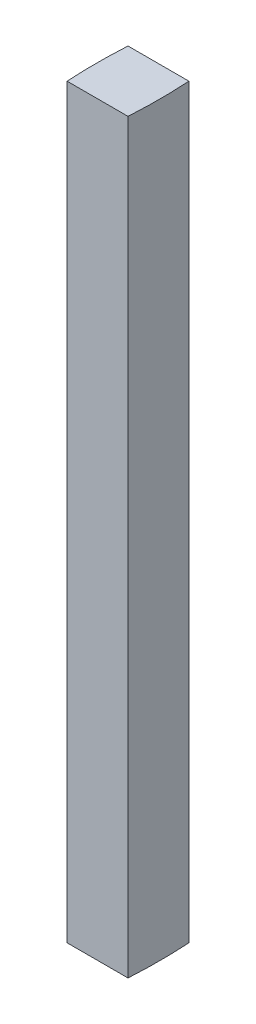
from build123d import *

# Parameters (mm, degrees)
DODANIE_WYCI_GNI_CIE1_DEPTH = 367.5


with BuildPart() as part:
    # Szkic1 → Dodanie-wyci_gni_cie1 (new body)
    with BuildSketch(Plane(origin=(0, 0, 0), x_dir=(1, 0, 0), z_dir=(0, 1, 0))):
        with BuildLine():
            Line((-19.549594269, 15), (10.450405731, 15))
            ThreePointArc((10.450405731, 15), (10.917823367, 0), (10.450405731, -15))
            Line((10.450405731, -15), (-19.549594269, -15))
            ThreePointArc((-19.549594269, -15), (-20, 0), (-19.549594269, 15))
        make_face()
    extrude(amount=DODANIE_WYCI_GNI_CIE1_DEPTH)


solid = part.part
